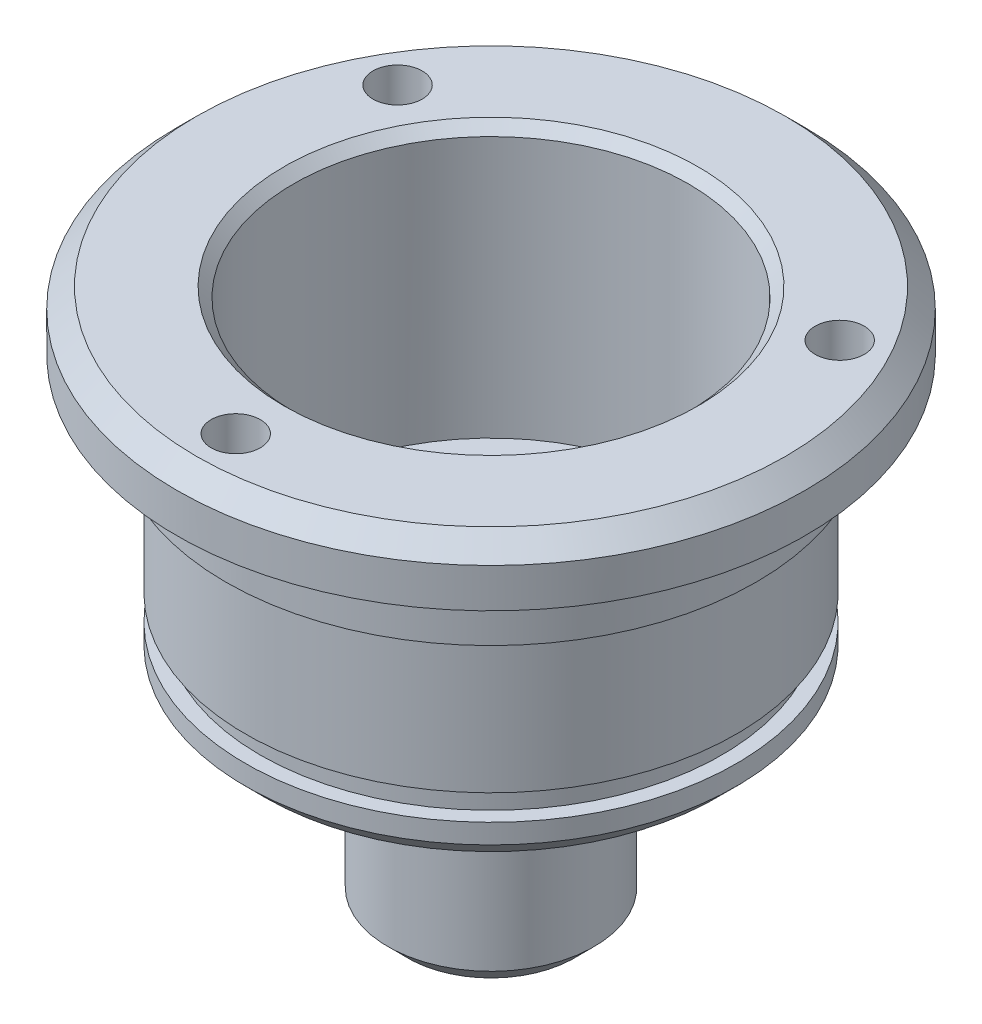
from build123d import *

# Parameters (mm, degrees)
CHAMFER_1_SIZE         = 1
CHAMFER_2_SIZE         = 1
HOLE_WIZARD_M3_2_D     = 2.5
HOLE_WIZARD_M3_2_DEPTH = 4
HOLE_WIZARD_M3_2_TIP   = 0.751075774
SKETCH_6_W             = 5.25
SKETCH_6_H             = 10.7
EXTRUDE_START          = -3
SKETCH_7_R             = 10.05
SKETCH_7_R_2           = 1.75
EXTRUDE_1_DEPTH        = 3
CHAMFER_3_SIZE         = 1
CHAMFER_4_SIZE         = 1
FILLET_1_R             = 0.2
CUT_EXTRUDE_START      = -77
SKETCH_8_R             = 1.75
CUT_EXTRUDE_1_DEPTH    = 77
HOLE_WIZARD_M5_1_D     = 4.2
SKETCH_12_R            = 1.5
CUT_EXTRUDE_2_DEPTH    = 77
CHAMFER_5_SIZE         = 0.5


with BuildPart() as part:
    # Sketch 1 → Revolve 1 (revolve)
    with BuildSketch(Plane.XY, mode=Mode.PRIVATE) as revolve_1_sk:
        Polygon((12.5, 0), (10.05, 0), (10.05, 16.8), (16, 16.8), (16, 13.8), (13.5, 13.8), (13.5, 10.5), (12.5, 10.5), (12.5, 3.3), (11.75, 3.3), (11.75, 2), (12.5, 2), align=None)
    revolve(revolve_1_sk.sketch.rotate(Axis((0, 0, 0), (0, 1, 0)), 90), axis=Axis((0, 0, 0), (0, 1, 0)))

    # Chamfer 1
    chamfer_1_edges = [part.edges().sort_by_distance(p)[0] for p in [
        (0, 0, 12.5),
    ]]
    chamfer(chamfer_1_edges, length=CHAMFER_1_SIZE)

    # Chamfer 2
    chamfer_2_edges = [part.edges().sort_by_distance(p)[0] for p in [
        (0, 16.8, 16),
    ]]
    chamfer(chamfer_2_edges, length=CHAMFER_2_SIZE)

    # Hole Wizard M3 _2
    with Locations(Plane(origin=(11.258330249, 16.8, -6.5), x_dir=(0, 0, 1), z_dir=(0, 1, 0))):
        with Locations((0, 0), (0, -22.516660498), (19.5, -11.258330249)):
            Hole(HOLE_WIZARD_M3_2_D / 2, depth=HOLE_WIZARD_M3_2_DEPTH)
            with Locations((0, 0, -(HOLE_WIZARD_M3_2_DEPTH + HOLE_WIZARD_M3_2_TIP / 2))):  # 118° drill point
                Cone(0, HOLE_WIZARD_M3_2_D / 2, HOLE_WIZARD_M3_2_TIP, mode=Mode.SUBTRACT)



with BuildPart() as body_2:
    # Sketch 6 → Revolve 2 (revolve)
    with BuildSketch(Plane.XY, mode=Mode.PRIVATE) as revolve_2_sk:
        with Locations((-2.625, -5.35)):
            Rectangle(SKETCH_6_W, SKETCH_6_H)
    revolve(revolve_2_sk.sketch.rotate(Axis((0, 0, 0), (0, -1, 0)), 270), axis=Axis((0, 0, 0), (0, -1, 0)))


with BuildPart() as part_1:
    add(part.part)

    add(body_2.part)  # Extrude 1 merges body 2
    # Sketch 7 → Extrude 1 (add)
    with BuildSketch(Plane.XZ.offset(EXTRUDE_START)):
        with Locations(Location((0, 0, 0), (0, 0, 270))):
            Circle(SKETCH_7_R)
        with Locations(Location((0, 0, 0), (0, 0, 270))):
            Circle(SKETCH_7_R_2, mode=Mode.SUBTRACT)
    extrude(amount=EXTRUDE_1_DEPTH)

    # Chamfer 3
    chamfer_3_edges = [part_1.edges().sort_by_distance(p)[0] for p in [
        (0, 3, 1.75),
    ]]
    chamfer(chamfer_3_edges, length=CHAMFER_3_SIZE)

    # Chamfer 4
    chamfer_4_edges = [part_1.edges().sort_by_distance(p)[0] for p in [
        (0, -10.7, -5.25),
    ]]
    chamfer(chamfer_4_edges, length=CHAMFER_4_SIZE)

    # Fillet 1
    fillet_1_edges = [part_1.edges().sort_by_distance(p)[0] for p in [
        (0, 0, -5.25),
    ]]
    fillet(fillet_1_edges, radius=FILLET_1_R)

    # Sketch 8 → Cut-Extrude 1 (cut)
    with BuildSketch(Plane.XZ.offset(10.7).offset(CUT_EXTRUDE_START)):
        with Locations(Location((0, 0, 0), (0, 0, 270))):
            Circle(SKETCH_8_R)
    extrude(amount=CUT_EXTRUDE_1_DEPTH, mode=Mode.SUBTRACT)

    # Hole Wizard M5 _1 (through all)
    with Locations(Plane(origin=(0, -10.7, 0), x_dir=(0, 0, -1), z_dir=(0, -1, 0))):
        with Locations((0, 0)):
            Hole(HOLE_WIZARD_M5_1_D / 2)

    # Sketch 12 → Cut-Extrude 2 (cut)
    with BuildSketch(Plane.XY):
        with Locations(Location((0, -7.7, 0), (0, 0, 89.99999997))):
            Circle(SKETCH_12_R)
    extrude(amount=-CUT_EXTRUDE_2_DEPTH, mode=Mode.SUBTRACT)

    # Chamfer 5
    chamfer_5_edges = [part_1.edges().sort_by_distance(p)[0] for p in [
        (0, 16.8, 10.05),
    ]]
    chamfer(chamfer_5_edges, length=CHAMFER_5_SIZE)


solid = part_1.part
